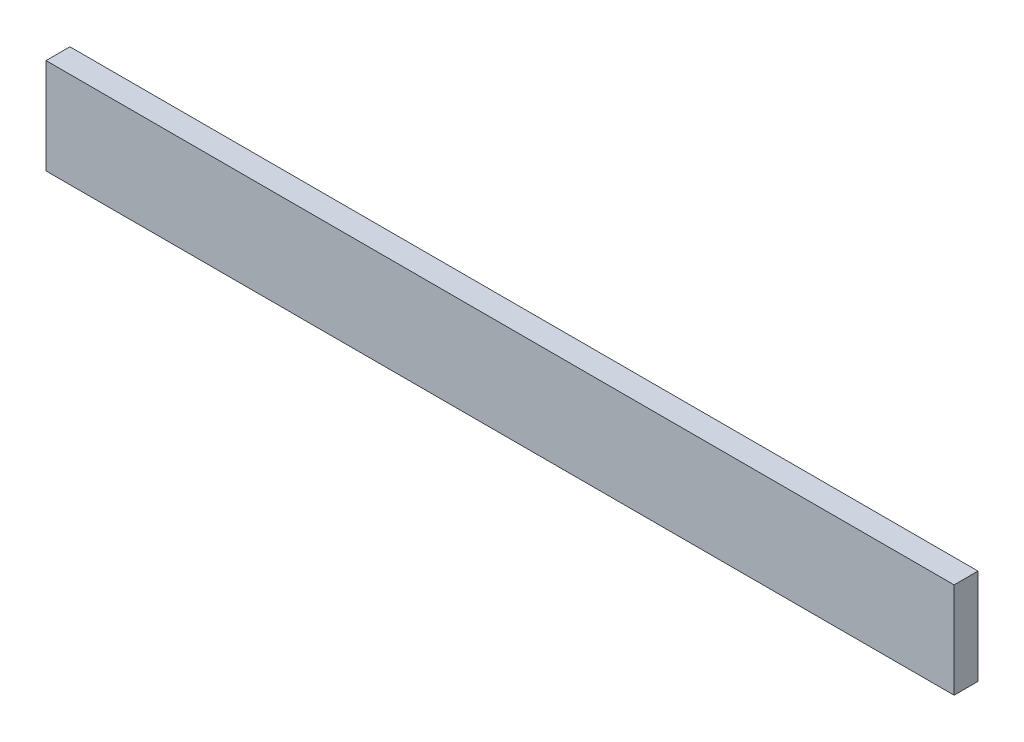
from build123d import *

# Parameters (mm, degrees)
SKETCH1_W           = 475
SKETCH1_H           = 50
BOSS_EXTRUDE1_DEPTH = 12.5


with BuildPart() as part:
    # Sketch1 → Boss-Extrude1 (new body)
    with BuildSketch(Plane.XY):
        Rectangle(SKETCH1_W, SKETCH1_H)
    extrude(amount=BOSS_EXTRUDE1_DEPTH)


solid = part.part
